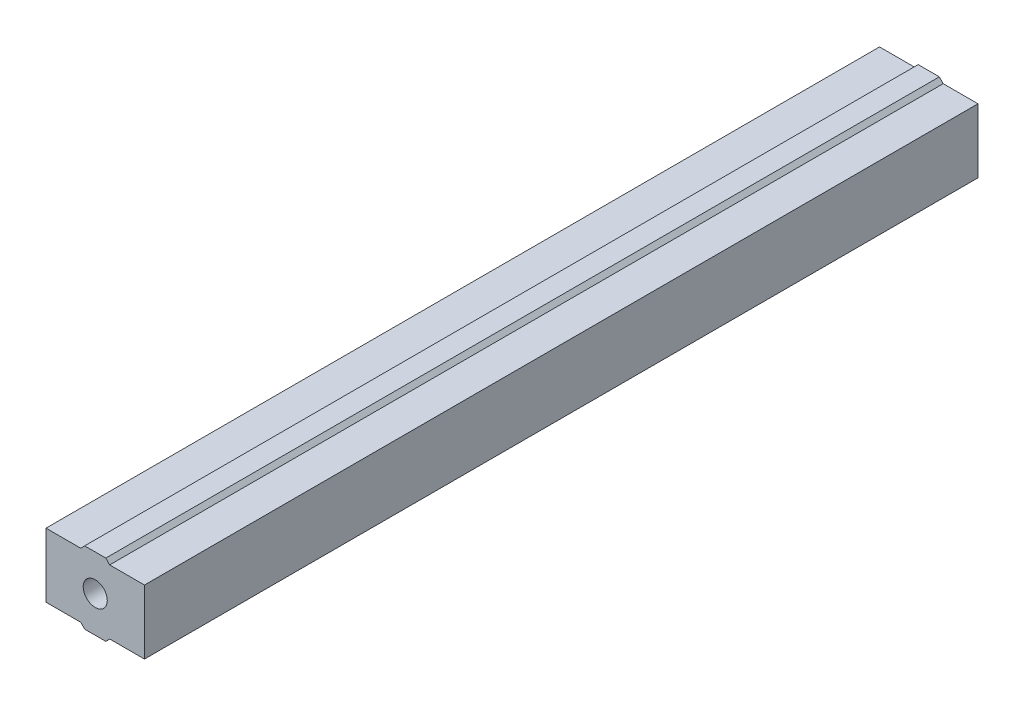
ISO-10303-21;
HEADER;
FILE_DESCRIPTION(('STEP AP214'),'2;1');
FILE_NAME('part.step','',(''),(''),'','','');
FILE_SCHEMA(('AUTOMOTIVE_DESIGN { 1 0 10303 214 1 1 1 1 }'));
ENDSEC;
DATA;
#1=APPLICATION_CONTEXT('core data for automotive mechanical design processes');
#2=APPLICATION_PROTOCOL_DEFINITION('international standard','automotive_design',2000,#1);
#3=PRODUCT_CONTEXT('',#1,'mechanical');
#4=PRODUCT('Part','Part','',(#3));
#5=PRODUCT_RELATED_PRODUCT_CATEGORY('part','',(#4));
#6=PRODUCT_DEFINITION_FORMATION('','',#4);
#7=PRODUCT_DEFINITION_CONTEXT('part definition',#1,'design');
#8=PRODUCT_DEFINITION('design','',#6,#7);
#9=PRODUCT_DEFINITION_SHAPE('','',#8);
#10=(LENGTH_UNIT() NAMED_UNIT(*) SI_UNIT(.MILLI.,.METRE.));
#11=(NAMED_UNIT(*) PLANE_ANGLE_UNIT() SI_UNIT($,.RADIAN.));
#12=(NAMED_UNIT(*) SI_UNIT($,.STERADIAN.) SOLID_ANGLE_UNIT());
#13=UNCERTAINTY_MEASURE_WITH_UNIT(LENGTH_MEASURE(1.E-05),#10,'distance_accuracy_value','');
#14=(GEOMETRIC_REPRESENTATION_CONTEXT(3) GLOBAL_UNCERTAINTY_ASSIGNED_CONTEXT((#13)) GLOBAL_UNIT_ASSIGNED_CONTEXT((#10,
#11,#12)) REPRESENTATION_CONTEXT('',''));
#15=CARTESIAN_POINT('',(0.,0.,0.));
#16=DIRECTION('',(0.,0.,1.));
#17=DIRECTION('',(1.,0.,0.));
#18=AXIS2_PLACEMENT_3D('',#15,#16,#17);
#19=CARTESIAN_POINT('',(-19.4945,-12.7,330.));
#20=DIRECTION('',(0.,0.,1.));
#21=DIRECTION('',(1.,0.,0.));
#22=AXIS2_PLACEMENT_3D('',#19,#20,#21);
#23=PLANE('',#22);
#24=DIRECTION('',(0.,-1.,0.));
#25=VECTOR('',#24,1.);
#26=CARTESIAN_POINT('',(-19.4945,12.7,330.));
#27=LINE('',#26,#25);
#28=CARTESIAN_POINT('',(-19.4945,12.7,330.));
#29=VERTEX_POINT('',#28);
#30=CARTESIAN_POINT('',(-19.4945,-12.7,330.));
#31=VERTEX_POINT('',#30);
#32=EDGE_CURVE('E175',#29,#31,#27,.T.);
#33=ORIENTED_EDGE('',*,*,#32,.T.);
#34=DIRECTION('',(1.,0.,0.));
#35=VECTOR('',#34,1.);
#36=CARTESIAN_POINT('',(-19.4945,-12.7,330.));
#37=LINE('',#36,#35);
#38=CARTESIAN_POINT('',(-5.71500000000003,-12.7,330.));
#39=VERTEX_POINT('',#38);
#40=EDGE_CURVE('E103',#31,#39,#37,.T.);
#41=ORIENTED_EDGE('',*,*,#40,.T.);
#42=DIRECTION('',(0.692531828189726,-0.721387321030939,0.));
#43=VECTOR('',#42,1.);
#44=CARTESIAN_POINT('',(-5.71500000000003,-12.7,330.));
#45=LINE('',#44,#43);
#46=CARTESIAN_POINT('',(-4.19099999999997,-14.2875,330.));
#47=VERTEX_POINT('',#46);
#48=EDGE_CURVE('E202',#39,#47,#45,.T.);
#49=ORIENTED_EDGE('',*,*,#48,.T.);
#50=DIRECTION('',(1.,0.,0.));
#51=VECTOR('',#50,1.);
#52=CARTESIAN_POINT('',(-4.19099999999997,-14.2875,330.));
#53=LINE('',#52,#51);
#54=CARTESIAN_POINT('',(4.19099999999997,-14.2875,330.));
#55=VERTEX_POINT('',#54);
#56=EDGE_CURVE('E221',#47,#55,#53,.T.);
#57=ORIENTED_EDGE('',*,*,#56,.T.);
#58=DIRECTION('',(0.692531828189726,0.72138732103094,0.));
#59=VECTOR('',#58,1.);
#60=CARTESIAN_POINT('',(4.19099999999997,-14.2875,330.));
#61=LINE('',#60,#59);
#62=CARTESIAN_POINT('',(5.71500000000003,-12.7,330.));
#63=VERTEX_POINT('',#62);
#64=EDGE_CURVE('E218',#55,#63,#61,.T.);
#65=ORIENTED_EDGE('',*,*,#64,.T.);
#66=DIRECTION('',(1.,0.,0.));
#67=VECTOR('',#66,1.);
#68=CARTESIAN_POINT('',(5.71500000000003,-12.7,330.));
#69=LINE('',#68,#67);
#70=CARTESIAN_POINT('',(19.4945,-12.7,330.));
#71=VERTEX_POINT('',#70);
#72=EDGE_CURVE('E220',#63,#71,#69,.T.);
#73=ORIENTED_EDGE('',*,*,#72,.T.);
#74=DIRECTION('',(0.,1.,0.));
#75=VECTOR('',#74,1.);
#76=CARTESIAN_POINT('',(19.4945,-12.7,330.));
#77=LINE('',#76,#75);
#78=CARTESIAN_POINT('',(19.4945,12.7,330.));
#79=VERTEX_POINT('',#78);
#80=EDGE_CURVE('E223',#71,#79,#77,.T.);
#81=ORIENTED_EDGE('',*,*,#80,.T.);
#82=DIRECTION('',(-1.,0.,0.));
#83=VECTOR('',#82,1.);
#84=CARTESIAN_POINT('',(19.4945,12.7,330.));
#85=LINE('',#84,#83);
#86=CARTESIAN_POINT('',(5.71500000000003,12.7,330.));
#87=VERTEX_POINT('',#86);
#88=EDGE_CURVE('E229',#79,#87,#85,.T.);
#89=ORIENTED_EDGE('',*,*,#88,.T.);
#90=DIRECTION('',(-0.692531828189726,0.721387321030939,0.));
#91=VECTOR('',#90,1.);
#92=CARTESIAN_POINT('',(5.71500000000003,12.7,330.));
#93=LINE('',#92,#91);
#94=CARTESIAN_POINT('',(4.19099999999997,14.2875,330.));
#95=VERTEX_POINT('',#94);
#96=EDGE_CURVE('E134',#87,#95,#93,.T.);
#97=ORIENTED_EDGE('',*,*,#96,.T.);
#98=DIRECTION('',(-1.,0.,0.));
#99=VECTOR('',#98,1.);
#100=CARTESIAN_POINT('',(4.19099999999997,14.2875,330.));
#101=LINE('',#100,#99);
#102=CARTESIAN_POINT('',(-4.19099999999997,14.2875,330.));
#103=VERTEX_POINT('',#102);
#104=EDGE_CURVE('E128',#95,#103,#101,.T.);
#105=ORIENTED_EDGE('',*,*,#104,.T.);
#106=DIRECTION('',(-0.692531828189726,-0.72138732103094,0.));
#107=VECTOR('',#106,1.);
#108=CARTESIAN_POINT('',(-4.19099999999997,14.2875,330.));
#109=LINE('',#108,#107);
#110=CARTESIAN_POINT('',(-5.71500000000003,12.7,330.));
#111=VERTEX_POINT('',#110);
#112=EDGE_CURVE('E132',#103,#111,#109,.T.);
#113=ORIENTED_EDGE('',*,*,#112,.T.);
#114=DIRECTION('',(-1.,0.,0.));
#115=VECTOR('',#114,1.);
#116=CARTESIAN_POINT('',(-5.71500000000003,12.7,330.));
#117=LINE('',#116,#115);
#118=EDGE_CURVE('E48',#111,#29,#117,.T.);
#119=ORIENTED_EDGE('',*,*,#118,.T.);
#120=EDGE_LOOP('',(#33,#41,#49,#57,#65,#73,#81,#89,#97,#105,#113,#119));
#121=FACE_BOUND('',#120,.T.);
#122=CARTESIAN_POINT('',(0.,0.,330.));
#123=DIRECTION('',(0.,0.,1.));
#124=DIRECTION('',(1.,0.,0.));
#125=AXIS2_PLACEMENT_3D('',#122,#123,#124);
#126=CIRCLE('',#125,4.7625);
#127=CARTESIAN_POINT('',(4.7625,0.,330.));
#128=VERTEX_POINT('',#127);
#129=EDGE_CURVE('E156',#128,#128,#126,.T.);
#130=ORIENTED_EDGE('',*,*,#129,.F.);
#131=EDGE_LOOP('',(#130));
#132=FACE_BOUND('',#131,.T.);
#133=ADVANCED_FACE('F31',(#121,#132),#23,.T.);
#134=CARTESIAN_POINT('',(-19.4945,-12.7,0.));
#135=DIRECTION('',(0.,0.,1.));
#136=DIRECTION('',(1.,0.,0.));
#137=AXIS2_PLACEMENT_3D('',#134,#135,#136);
#138=PLANE('',#137);
#139=DIRECTION('',(0.,-1.,0.));
#140=VECTOR('',#139,1.);
#141=CARTESIAN_POINT('',(-19.4945,12.7,0.));
#142=LINE('',#141,#140);
#143=CARTESIAN_POINT('',(-19.4945,12.7,0.));
#144=VERTEX_POINT('',#143);
#145=CARTESIAN_POINT('',(-19.4945,-12.7,0.));
#146=VERTEX_POINT('',#145);
#147=EDGE_CURVE('E152',#144,#146,#142,.T.);
#148=ORIENTED_EDGE('',*,*,#147,.F.);
#149=DIRECTION('',(-1.,0.,0.));
#150=VECTOR('',#149,1.);
#151=CARTESIAN_POINT('',(-5.71500000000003,12.7,0.));
#152=LINE('',#151,#150);
#153=CARTESIAN_POINT('',(-5.71500000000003,12.7,0.));
#154=VERTEX_POINT('',#153);
#155=EDGE_CURVE('E95',#154,#144,#152,.T.);
#156=ORIENTED_EDGE('',*,*,#155,.F.);
#157=DIRECTION('',(-0.692531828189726,-0.72138732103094,0.));
#158=VECTOR('',#157,1.);
#159=CARTESIAN_POINT('',(-4.19099999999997,14.2875,0.));
#160=LINE('',#159,#158);
#161=CARTESIAN_POINT('',(-4.19099999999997,14.2875,0.));
#162=VERTEX_POINT('',#161);
#163=EDGE_CURVE('E89',#162,#154,#160,.T.);
#164=ORIENTED_EDGE('',*,*,#163,.F.);
#165=DIRECTION('',(-1.,0.,0.));
#166=VECTOR('',#165,1.);
#167=CARTESIAN_POINT('',(4.19099999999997,14.2875,0.));
#168=LINE('',#167,#166);
#169=CARTESIAN_POINT('',(4.19099999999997,14.2875,0.));
#170=VERTEX_POINT('',#169);
#171=EDGE_CURVE('E142',#170,#162,#168,.T.);
#172=ORIENTED_EDGE('',*,*,#171,.F.);
#173=DIRECTION('',(-0.692531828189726,0.721387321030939,0.));
#174=VECTOR('',#173,1.);
#175=CARTESIAN_POINT('',(5.71500000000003,12.7,0.));
#176=LINE('',#175,#174);
#177=CARTESIAN_POINT('',(5.71500000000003,12.7,0.));
#178=VERTEX_POINT('',#177);
#179=EDGE_CURVE('E170',#178,#170,#176,.T.);
#180=ORIENTED_EDGE('',*,*,#179,.F.);
#181=DIRECTION('',(-1.,0.,0.));
#182=VECTOR('',#181,1.);
#183=CARTESIAN_POINT('',(19.4945,12.7,0.));
#184=LINE('',#183,#182);
#185=CARTESIAN_POINT('',(19.4945,12.7,0.));
#186=VERTEX_POINT('',#185);
#187=EDGE_CURVE('E168',#186,#178,#184,.T.);
#188=ORIENTED_EDGE('',*,*,#187,.F.);
#189=DIRECTION('',(0.,1.,0.));
#190=VECTOR('',#189,1.);
#191=CARTESIAN_POINT('',(19.4945,-12.7,0.));
#192=LINE('',#191,#190);
#193=CARTESIAN_POINT('',(19.4945,-12.7,0.));
#194=VERTEX_POINT('',#193);
#195=EDGE_CURVE('E166',#194,#186,#192,.T.);
#196=ORIENTED_EDGE('',*,*,#195,.F.);
#197=DIRECTION('',(1.,0.,0.));
#198=VECTOR('',#197,1.);
#199=CARTESIAN_POINT('',(5.71500000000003,-12.7,0.));
#200=LINE('',#199,#198);
#201=CARTESIAN_POINT('',(5.71500000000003,-12.7,0.));
#202=VERTEX_POINT('',#201);
#203=EDGE_CURVE('E164',#202,#194,#200,.T.);
#204=ORIENTED_EDGE('',*,*,#203,.F.);
#205=DIRECTION('',(0.692531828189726,0.72138732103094,0.));
#206=VECTOR('',#205,1.);
#207=CARTESIAN_POINT('',(4.19099999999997,-14.2875,0.));
#208=LINE('',#207,#206);
#209=CARTESIAN_POINT('',(4.19099999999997,-14.2875,0.));
#210=VERTEX_POINT('',#209);
#211=EDGE_CURVE('E162',#210,#202,#208,.T.);
#212=ORIENTED_EDGE('',*,*,#211,.F.);
#213=DIRECTION('',(1.,0.,0.));
#214=VECTOR('',#213,1.);
#215=CARTESIAN_POINT('',(-4.19099999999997,-14.2875,0.));
#216=LINE('',#215,#214);
#217=CARTESIAN_POINT('',(-4.19099999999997,-14.2875,0.));
#218=VERTEX_POINT('',#217);
#219=EDGE_CURVE('E160',#218,#210,#216,.T.);
#220=ORIENTED_EDGE('',*,*,#219,.F.);
#221=DIRECTION('',(0.692531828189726,-0.721387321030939,0.));
#222=VECTOR('',#221,1.);
#223=CARTESIAN_POINT('',(-5.71500000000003,-12.7,0.));
#224=LINE('',#223,#222);
#225=CARTESIAN_POINT('',(-5.71500000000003,-12.7,0.));
#226=VERTEX_POINT('',#225);
#227=EDGE_CURVE('E158',#226,#218,#224,.T.);
#228=ORIENTED_EDGE('',*,*,#227,.F.);
#229=DIRECTION('',(1.,0.,0.));
#230=VECTOR('',#229,1.);
#231=CARTESIAN_POINT('',(-19.4945,-12.7,0.));
#232=LINE('',#231,#230);
#233=EDGE_CURVE('E155',#146,#226,#232,.T.);
#234=ORIENTED_EDGE('',*,*,#233,.F.);
#235=EDGE_LOOP('',(#148,#156,#164,#172,#180,#188,#196,#204,#212,#220,#228,#234));
#236=FACE_BOUND('',#235,.T.);
#237=CARTESIAN_POINT('',(0.,0.,0.));
#238=DIRECTION('',(0.,0.,1.));
#239=DIRECTION('',(1.,0.,0.));
#240=AXIS2_PLACEMENT_3D('',#237,#238,#239);
#241=CIRCLE('',#240,4.7625);
#242=CARTESIAN_POINT('',(4.7625,0.,0.));
#243=VERTEX_POINT('',#242);
#244=EDGE_CURVE('E376',#243,#243,#241,.T.);
#245=ORIENTED_EDGE('',*,*,#244,.T.);
#246=EDGE_LOOP('',(#245));
#247=FACE_BOUND('',#246,.T.);
#248=ADVANCED_FACE('F206',(#236,#247),#138,.F.);
#249=CARTESIAN_POINT('',(-19.4945,12.7,330.));
#250=DIRECTION('',(1.,0.,0.));
#251=DIRECTION('',(0.,0.,-1.));
#252=AXIS2_PLACEMENT_3D('',#249,#250,#251);
#253=PLANE('',#252);
#254=ORIENTED_EDGE('',*,*,#147,.T.);
#255=DIRECTION('',(0.,0.,-1.));
#256=VECTOR('',#255,1.);
#257=CARTESIAN_POINT('',(-19.4945,-12.7,330.));
#258=LINE('',#257,#256);
#259=EDGE_CURVE('E11',#31,#146,#258,.T.);
#260=ORIENTED_EDGE('',*,*,#259,.F.);
#261=ORIENTED_EDGE('',*,*,#32,.F.);
#262=DIRECTION('',(0.,0.,-1.));
#263=VECTOR('',#262,1.);
#264=CARTESIAN_POINT('',(-19.4945,12.7,330.));
#265=LINE('',#264,#263);
#266=EDGE_CURVE('E148',#29,#144,#265,.T.);
#267=ORIENTED_EDGE('',*,*,#266,.T.);
#268=EDGE_LOOP('',(#254,#260,#261,#267));
#269=FACE_BOUND('',#268,.T.);
#270=ADVANCED_FACE('F33',(#269),#253,.F.);
#271=CARTESIAN_POINT('',(-19.4945,-12.7,330.));
#272=DIRECTION('',(0.,1.,0.));
#273=DIRECTION('',(-1.,0.,0.));
#274=AXIS2_PLACEMENT_3D('',#271,#272,#273);
#275=PLANE('',#274);
#276=ORIENTED_EDGE('',*,*,#233,.T.);
#277=DIRECTION('',(0.,0.,-1.));
#278=VECTOR('',#277,1.);
#279=CARTESIAN_POINT('',(-5.71500000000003,-12.7,330.));
#280=LINE('',#279,#278);
#281=EDGE_CURVE('E40',#39,#226,#280,.T.);
#282=ORIENTED_EDGE('',*,*,#281,.F.);
#283=ORIENTED_EDGE('',*,*,#40,.F.);
#284=ORIENTED_EDGE('',*,*,#259,.T.);
#285=EDGE_LOOP('',(#276,#282,#283,#284));
#286=FACE_BOUND('',#285,.T.);
#287=ADVANCED_FACE('F263',(#286),#275,.F.);
#288=CARTESIAN_POINT('',(-5.71500000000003,-12.7,330.));
#289=DIRECTION('',(0.721387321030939,0.692531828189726,0.));
#290=DIRECTION('',(-0.692531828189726,0.721387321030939,0.));
#291=AXIS2_PLACEMENT_3D('',#288,#289,#290);
#292=PLANE('',#291);
#293=ORIENTED_EDGE('',*,*,#227,.T.);
#294=DIRECTION('',(0.,0.,-1.));
#295=VECTOR('',#294,1.);
#296=CARTESIAN_POINT('',(-4.19099999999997,-14.2875,330.));
#297=LINE('',#296,#295);
#298=EDGE_CURVE('E194',#47,#218,#297,.T.);
#299=ORIENTED_EDGE('',*,*,#298,.F.);
#300=ORIENTED_EDGE('',*,*,#48,.F.);
#301=ORIENTED_EDGE('',*,*,#281,.T.);
#302=EDGE_LOOP('',(#293,#299,#300,#301));
#303=FACE_BOUND('',#302,.T.);
#304=ADVANCED_FACE('F200',(#303),#292,.F.);
#305=CARTESIAN_POINT('',(-4.19099999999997,-14.2875,330.));
#306=DIRECTION('',(0.,1.,0.));
#307=DIRECTION('',(0.,0.,1.));
#308=AXIS2_PLACEMENT_3D('',#305,#306,#307);
#309=PLANE('',#308);
#310=ORIENTED_EDGE('',*,*,#219,.T.);
#311=DIRECTION('',(0.,0.,-1.));
#312=VECTOR('',#311,1.);
#313=CARTESIAN_POINT('',(4.19099999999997,-14.2875,330.));
#314=LINE('',#313,#312);
#315=EDGE_CURVE('E191',#55,#210,#314,.T.);
#316=ORIENTED_EDGE('',*,*,#315,.F.);
#317=ORIENTED_EDGE('',*,*,#56,.F.);
#318=ORIENTED_EDGE('',*,*,#298,.T.);
#319=EDGE_LOOP('',(#310,#316,#317,#318));
#320=FACE_BOUND('',#319,.T.);
#321=ADVANCED_FACE('F212',(#320),#309,.F.);
#322=CARTESIAN_POINT('',(4.19099999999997,-14.2875,330.));
#323=DIRECTION('',(-0.72138732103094,0.692531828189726,0.));
#324=DIRECTION('',(-0.692531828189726,-0.72138732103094,0.));
#325=AXIS2_PLACEMENT_3D('',#322,#323,#324);
#326=PLANE('',#325);
#327=ORIENTED_EDGE('',*,*,#211,.T.);
#328=DIRECTION('',(0.,0.,-1.));
#329=VECTOR('',#328,1.);
#330=CARTESIAN_POINT('',(5.71500000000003,-12.7,330.));
#331=LINE('',#330,#329);
#332=EDGE_CURVE('E188',#63,#202,#331,.T.);
#333=ORIENTED_EDGE('',*,*,#332,.F.);
#334=ORIENTED_EDGE('',*,*,#64,.F.);
#335=ORIENTED_EDGE('',*,*,#315,.T.);
#336=EDGE_LOOP('',(#327,#333,#334,#335));
#337=FACE_BOUND('',#336,.T.);
#338=ADVANCED_FACE('F216',(#337),#326,.F.);
#339=CARTESIAN_POINT('',(5.71500000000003,-12.7,330.));
#340=DIRECTION('',(0.,1.,0.));
#341=DIRECTION('',(0.,0.,1.));
#342=AXIS2_PLACEMENT_3D('',#339,#340,#341);
#343=PLANE('',#342);
#344=ORIENTED_EDGE('',*,*,#203,.T.);
#345=DIRECTION('',(0.,0.,-1.));
#346=VECTOR('',#345,1.);
#347=CARTESIAN_POINT('',(19.4945,-12.7,330.));
#348=LINE('',#347,#346);
#349=EDGE_CURVE('E185',#71,#194,#348,.T.);
#350=ORIENTED_EDGE('',*,*,#349,.F.);
#351=ORIENTED_EDGE('',*,*,#72,.F.);
#352=ORIENTED_EDGE('',*,*,#332,.T.);
#353=EDGE_LOOP('',(#344,#350,#351,#352));
#354=FACE_BOUND('',#353,.T.);
#355=ADVANCED_FACE('F276',(#354),#343,.F.);
#356=CARTESIAN_POINT('',(19.4945,-12.7,330.));
#357=DIRECTION('',(-1.,0.,0.));
#358=DIRECTION('',(0.,0.,1.));
#359=AXIS2_PLACEMENT_3D('',#356,#357,#358);
#360=PLANE('',#359);
#361=ORIENTED_EDGE('',*,*,#195,.T.);
#362=DIRECTION('',(0.,0.,-1.));
#363=VECTOR('',#362,1.);
#364=CARTESIAN_POINT('',(19.4945,12.7,330.));
#365=LINE('',#364,#363);
#366=EDGE_CURVE('E182',#79,#186,#365,.T.);
#367=ORIENTED_EDGE('',*,*,#366,.F.);
#368=ORIENTED_EDGE('',*,*,#80,.F.);
#369=ORIENTED_EDGE('',*,*,#349,.T.);
#370=EDGE_LOOP('',(#361,#367,#368,#369));
#371=FACE_BOUND('',#370,.T.);
#372=ADVANCED_FACE('F279',(#371),#360,.F.);
#373=CARTESIAN_POINT('',(19.4945,12.7,330.));
#374=DIRECTION('',(0.,-1.,0.));
#375=DIRECTION('',(1.,0.,0.));
#376=AXIS2_PLACEMENT_3D('',#373,#374,#375);
#377=PLANE('',#376);
#378=ORIENTED_EDGE('',*,*,#187,.T.);
#379=DIRECTION('',(0.,0.,-1.));
#380=VECTOR('',#379,1.);
#381=CARTESIAN_POINT('',(5.71500000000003,12.7,330.));
#382=LINE('',#381,#380);
#383=EDGE_CURVE('E179',#87,#178,#382,.T.);
#384=ORIENTED_EDGE('',*,*,#383,.F.);
#385=ORIENTED_EDGE('',*,*,#88,.F.);
#386=ORIENTED_EDGE('',*,*,#366,.T.);
#387=EDGE_LOOP('',(#378,#384,#385,#386));
#388=FACE_BOUND('',#387,.T.);
#389=ADVANCED_FACE('F235',(#388),#377,.F.);
#390=CARTESIAN_POINT('',(5.71500000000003,12.7,330.));
#391=DIRECTION('',(-0.721387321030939,-0.692531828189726,0.));
#392=DIRECTION('',(0.692531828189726,-0.721387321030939,0.));
#393=AXIS2_PLACEMENT_3D('',#390,#391,#392);
#394=PLANE('',#393);
#395=ORIENTED_EDGE('',*,*,#179,.T.);
#396=DIRECTION('',(0.,0.,-1.));
#397=VECTOR('',#396,1.);
#398=CARTESIAN_POINT('',(4.19099999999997,14.2875,330.));
#399=LINE('',#398,#397);
#400=EDGE_CURVE('E143',#95,#170,#399,.T.);
#401=ORIENTED_EDGE('',*,*,#400,.F.);
#402=ORIENTED_EDGE('',*,*,#96,.F.);
#403=ORIENTED_EDGE('',*,*,#383,.T.);
#404=EDGE_LOOP('',(#395,#401,#402,#403));
#405=FACE_BOUND('',#404,.T.);
#406=ADVANCED_FACE('F239',(#405),#394,.F.);
#407=CARTESIAN_POINT('',(4.19099999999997,14.2875,330.));
#408=DIRECTION('',(0.,-1.,0.));
#409=DIRECTION('',(0.,0.,-1.));
#410=AXIS2_PLACEMENT_3D('',#407,#408,#409);
#411=PLANE('',#410);
#412=ORIENTED_EDGE('',*,*,#171,.T.);
#413=DIRECTION('',(0.,0.,-1.));
#414=VECTOR('',#413,1.);
#415=CARTESIAN_POINT('',(-4.19099999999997,14.2875,330.));
#416=LINE('',#415,#414);
#417=EDGE_CURVE('E139',#103,#162,#416,.T.);
#418=ORIENTED_EDGE('',*,*,#417,.F.);
#419=ORIENTED_EDGE('',*,*,#104,.F.);
#420=ORIENTED_EDGE('',*,*,#400,.T.);
#421=EDGE_LOOP('',(#412,#418,#419,#420));
#422=FACE_BOUND('',#421,.T.);
#423=ADVANCED_FACE('F140',(#422),#411,.F.);
#424=CARTESIAN_POINT('',(-4.19099999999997,14.2875,330.));
#425=DIRECTION('',(0.72138732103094,-0.692531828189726,0.));
#426=DIRECTION('',(0.692531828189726,0.72138732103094,0.));
#427=AXIS2_PLACEMENT_3D('',#424,#425,#426);
#428=PLANE('',#427);
#429=ORIENTED_EDGE('',*,*,#163,.T.);
#430=DIRECTION('',(0.,0.,-1.));
#431=VECTOR('',#430,1.);
#432=CARTESIAN_POINT('',(-5.71500000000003,12.7,330.));
#433=LINE('',#432,#431);
#434=EDGE_CURVE('E144',#111,#154,#433,.T.);
#435=ORIENTED_EDGE('',*,*,#434,.F.);
#436=ORIENTED_EDGE('',*,*,#112,.F.);
#437=ORIENTED_EDGE('',*,*,#417,.T.);
#438=EDGE_LOOP('',(#429,#435,#436,#437));
#439=FACE_BOUND('',#438,.T.);
#440=ADVANCED_FACE('F146',(#439),#428,.F.);
#441=CARTESIAN_POINT('',(-5.71500000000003,12.7,330.));
#442=DIRECTION('',(0.,-1.,0.));
#443=DIRECTION('',(0.,0.,-1.));
#444=AXIS2_PLACEMENT_3D('',#441,#442,#443);
#445=PLANE('',#444);
#446=ORIENTED_EDGE('',*,*,#155,.T.);
#447=ORIENTED_EDGE('',*,*,#266,.F.);
#448=ORIENTED_EDGE('',*,*,#118,.F.);
#449=ORIENTED_EDGE('',*,*,#434,.T.);
#450=EDGE_LOOP('',(#446,#447,#448,#449));
#451=FACE_BOUND('',#450,.T.);
#452=ADVANCED_FACE('F243',(#451),#445,.F.);
#453=CARTESIAN_POINT('',(0.,0.,330.));
#454=DIRECTION('',(0.,0.,-1.));
#455=DIRECTION('',(-1.,0.,0.));
#456=AXIS2_PLACEMENT_3D('',#453,#454,#455);
#457=CYLINDRICAL_SURFACE('',#456,4.7625);
#458=ORIENTED_EDGE('',*,*,#129,.T.);
#459=EDGE_LOOP('',(#458));
#460=FACE_BOUND('',#459,.T.);
#461=ORIENTED_EDGE('',*,*,#244,.F.);
#462=EDGE_LOOP('',(#461));
#463=FACE_BOUND('',#462,.T.);
#464=ADVANCED_FACE('F245',(#460,#463),#457,.F.);
#465=CLOSED_SHELL('',(#133,#248,#270,#287,#304,#321,#338,#355,#372,#389,#406,#423,#440,#452,#464));
#466=MANIFOLD_SOLID_BREP('B2',#465);
#467=ADVANCED_BREP_SHAPE_REPRESENTATION('',(#18,#466),#14);
#468=SHAPE_DEFINITION_REPRESENTATION(#9,#467);
ENDSEC;
END-ISO-10303-21;
